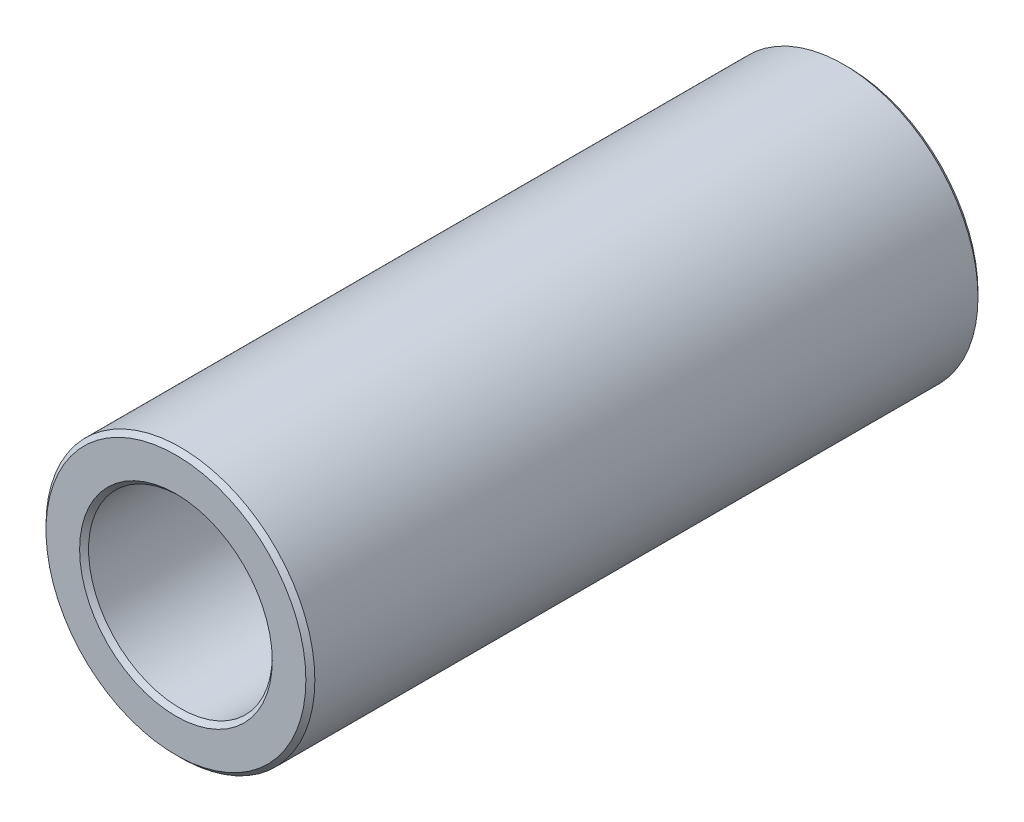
ISO-10303-21;
HEADER;
FILE_DESCRIPTION(('STEP AP214'),'2;1');
FILE_NAME('part.step','',(''),(''),'','','');
FILE_SCHEMA(('AUTOMOTIVE_DESIGN { 1 0 10303 214 1 1 1 1 }'));
ENDSEC;
DATA;
#1=APPLICATION_CONTEXT('core data for automotive mechanical design processes');
#2=APPLICATION_PROTOCOL_DEFINITION('international standard','automotive_design',2000,#1);
#3=PRODUCT_CONTEXT('',#1,'mechanical');
#4=PRODUCT('Part','Part','',(#3));
#5=PRODUCT_RELATED_PRODUCT_CATEGORY('part','',(#4));
#6=PRODUCT_DEFINITION_FORMATION('','',#4);
#7=PRODUCT_DEFINITION_CONTEXT('part definition',#1,'design');
#8=PRODUCT_DEFINITION('design','',#6,#7);
#9=PRODUCT_DEFINITION_SHAPE('','',#8);
#10=(LENGTH_UNIT() NAMED_UNIT(*) SI_UNIT(.MILLI.,.METRE.));
#11=(NAMED_UNIT(*) PLANE_ANGLE_UNIT() SI_UNIT($,.RADIAN.));
#12=(NAMED_UNIT(*) SI_UNIT($,.STERADIAN.) SOLID_ANGLE_UNIT());
#13=UNCERTAINTY_MEASURE_WITH_UNIT(LENGTH_MEASURE(1.E-05),#10,'distance_accuracy_value','');
#14=(GEOMETRIC_REPRESENTATION_CONTEXT(3) GLOBAL_UNCERTAINTY_ASSIGNED_CONTEXT((#13)) GLOBAL_UNIT_ASSIGNED_CONTEXT((#10,
#11,#12)) REPRESENTATION_CONTEXT('',''));
#15=CARTESIAN_POINT('',(0.,0.,0.));
#16=DIRECTION('',(0.,0.,1.));
#17=DIRECTION('',(1.,0.,0.));
#18=AXIS2_PLACEMENT_3D('',#15,#16,#17);
#19=CARTESIAN_POINT('',(0.,0.,15.));
#20=DIRECTION('',(0.,0.,1.));
#21=DIRECTION('',(1.,0.,0.));
#22=AXIS2_PLACEMENT_3D('',#19,#20,#21);
#23=PLANE('',#22);
#24=CARTESIAN_POINT('',(0.,0.,15.));
#25=DIRECTION('',(0.,0.,1.));
#26=DIRECTION('',(1.,0.,0.));
#27=AXIS2_PLACEMENT_3D('',#24,#25,#26);
#28=CIRCLE('',#27,4.29999999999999);
#29=CARTESIAN_POINT('',(4.29999999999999,0.,15.));
#30=VERTEX_POINT('',#29);
#31=EDGE_CURVE('E10',#30,#30,#28,.F.);
#32=ORIENTED_EDGE('',*,*,#31,.T.);
#33=EDGE_LOOP('',(#32));
#34=FACE_BOUND('',#33,.T.);
#35=CARTESIAN_POINT('',(0.,0.,15.));
#36=DIRECTION('',(0.,0.,1.));
#37=DIRECTION('',(1.,0.,0.));
#38=AXIS2_PLACEMENT_3D('',#35,#36,#37);
#39=CIRCLE('',#38,5.8);
#40=CARTESIAN_POINT('',(5.8,0.,15.));
#41=VERTEX_POINT('',#40);
#42=EDGE_CURVE('E45',#41,#41,#39,.T.);
#43=ORIENTED_EDGE('',*,*,#42,.T.);
#44=EDGE_LOOP('',(#43));
#45=FACE_BOUND('',#44,.T.);
#46=ADVANCED_FACE('F37',(#34,#45),#23,.T.);
#47=CARTESIAN_POINT('',(0.,0.,-15.));
#48=DIRECTION('',(0.,0.,1.));
#49=DIRECTION('',(1.,0.,0.));
#50=AXIS2_PLACEMENT_3D('',#47,#48,#49);
#51=PLANE('',#50);
#52=CARTESIAN_POINT('',(0.,0.,-15.));
#53=DIRECTION('',(0.,0.,1.));
#54=DIRECTION('',(1.,0.,0.));
#55=AXIS2_PLACEMENT_3D('',#52,#53,#54);
#56=CIRCLE('',#55,5.8);
#57=CARTESIAN_POINT('',(5.8,0.,-15.));
#58=VERTEX_POINT('',#57);
#59=EDGE_CURVE('E61',#58,#58,#56,.F.);
#60=ORIENTED_EDGE('',*,*,#59,.T.);
#61=EDGE_LOOP('',(#60));
#62=FACE_BOUND('',#61,.T.);
#63=CARTESIAN_POINT('',(0.,0.,-15.));
#64=DIRECTION('',(0.,0.,1.));
#65=DIRECTION('',(1.,0.,0.));
#66=AXIS2_PLACEMENT_3D('',#63,#64,#65);
#67=CIRCLE('',#66,4.3);
#68=CARTESIAN_POINT('',(4.3,0.,-15.));
#69=VERTEX_POINT('',#68);
#70=EDGE_CURVE('E65',#69,#69,#67,.T.);
#71=ORIENTED_EDGE('',*,*,#70,.T.);
#72=EDGE_LOOP('',(#71));
#73=FACE_BOUND('',#72,.T.);
#74=ADVANCED_FACE('F89',(#62,#73),#51,.F.);
#75=CARTESIAN_POINT('',(0.,0.,15.));
#76=DIRECTION('',(0.,0.,-1.));
#77=DIRECTION('',(-1.,0.,0.));
#78=AXIS2_PLACEMENT_3D('',#75,#76,#77);
#79=CYLINDRICAL_SURFACE('',#78,6.);
#80=CARTESIAN_POINT('',(0.,0.,-14.8));
#81=DIRECTION('',(0.,0.,1.));
#82=DIRECTION('',(1.,0.,0.));
#83=AXIS2_PLACEMENT_3D('',#80,#81,#82);
#84=CIRCLE('',#83,6.);
#85=CARTESIAN_POINT('',(6.,0.,-14.8));
#86=VERTEX_POINT('',#85);
#87=EDGE_CURVE('E69',#86,#86,#84,.T.);
#88=ORIENTED_EDGE('',*,*,#87,.T.);
#89=EDGE_LOOP('',(#88));
#90=FACE_BOUND('',#89,.T.);
#91=CARTESIAN_POINT('',(0.,0.,14.8));
#92=DIRECTION('',(0.,0.,1.));
#93=DIRECTION('',(1.,0.,0.));
#94=AXIS2_PLACEMENT_3D('',#91,#92,#93);
#95=CIRCLE('',#94,6.);
#96=CARTESIAN_POINT('',(6.,0.,14.8));
#97=VERTEX_POINT('',#96);
#98=EDGE_CURVE('E73',#97,#97,#95,.F.);
#99=ORIENTED_EDGE('',*,*,#98,.T.);
#100=EDGE_LOOP('',(#99));
#101=FACE_BOUND('',#100,.T.);
#102=ADVANCED_FACE('F78',(#90,#101),#79,.T.);
#103=CARTESIAN_POINT('',(0.,0.,15.));
#104=DIRECTION('',(0.,0.,-1.));
#105=DIRECTION('',(-1.,0.,0.));
#106=AXIS2_PLACEMENT_3D('',#103,#104,#105);
#107=CYLINDRICAL_SURFACE('',#106,4.1);
#108=CARTESIAN_POINT('',(0.,0.,-14.8));
#109=DIRECTION('',(0.,0.,1.));
#110=DIRECTION('',(1.,0.,0.));
#111=AXIS2_PLACEMENT_3D('',#108,#109,#110);
#112=CIRCLE('',#111,4.1);
#113=CARTESIAN_POINT('',(4.1,0.,-14.8));
#114=VERTEX_POINT('',#113);
#115=EDGE_CURVE('E51',#114,#114,#112,.F.);
#116=ORIENTED_EDGE('',*,*,#115,.T.);
#117=EDGE_LOOP('',(#116));
#118=FACE_BOUND('',#117,.T.);
#119=CARTESIAN_POINT('',(0.,0.,14.8));
#120=DIRECTION('',(0.,0.,1.));
#121=DIRECTION('',(1.,0.,0.));
#122=AXIS2_PLACEMENT_3D('',#119,#120,#121);
#123=CIRCLE('',#122,4.1);
#124=CARTESIAN_POINT('',(4.1,0.,14.8));
#125=VERTEX_POINT('',#124);
#126=EDGE_CURVE('E55',#125,#125,#123,.T.);
#127=ORIENTED_EDGE('',*,*,#126,.T.);
#128=EDGE_LOOP('',(#127));
#129=FACE_BOUND('',#128,.T.);
#130=ADVANCED_FACE('F97',(#118,#129),#107,.F.);
#131=CARTESIAN_POINT('',(0.,0.,-14.8));
#132=DIRECTION('',(0.,0.,1.));
#133=DIRECTION('',(1.,0.,0.));
#134=AXIS2_PLACEMENT_3D('',#131,#132,#133);
#135=CONICAL_SURFACE('',#134,6.,0.785398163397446);
#136=ORIENTED_EDGE('',*,*,#59,.F.);
#137=EDGE_LOOP('',(#136));
#138=FACE_BOUND('',#137,.T.);
#139=ORIENTED_EDGE('',*,*,#87,.F.);
#140=EDGE_LOOP('',(#139));
#141=FACE_BOUND('',#140,.T.);
#142=ADVANCED_FACE('F102',(#138,#141),#135,.T.);
#143=CARTESIAN_POINT('',(0.,0.,-15.));
#144=DIRECTION('',(0.,0.,-1.));
#145=DIRECTION('',(-1.,0.,0.));
#146=AXIS2_PLACEMENT_3D('',#143,#144,#145);
#147=CONICAL_SURFACE('',#146,4.3,0.785398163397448);
#148=ORIENTED_EDGE('',*,*,#115,.F.);
#149=EDGE_LOOP('',(#148));
#150=FACE_BOUND('',#149,.T.);
#151=ORIENTED_EDGE('',*,*,#70,.F.);
#152=EDGE_LOOP('',(#151));
#153=FACE_BOUND('',#152,.T.);
#154=ADVANCED_FACE('F86',(#150,#153),#147,.F.);
#155=CARTESIAN_POINT('',(0.,0.,14.8));
#156=DIRECTION('',(0.,0.,1.));
#157=DIRECTION('',(1.,0.,0.));
#158=AXIS2_PLACEMENT_3D('',#155,#156,#157);
#159=CONICAL_SURFACE('',#158,4.1,0.78539816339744);
#160=ORIENTED_EDGE('',*,*,#31,.F.);
#161=EDGE_LOOP('',(#160));
#162=FACE_BOUND('',#161,.T.);
#163=ORIENTED_EDGE('',*,*,#126,.F.);
#164=EDGE_LOOP('',(#163));
#165=FACE_BOUND('',#164,.T.);
#166=ADVANCED_FACE('F82',(#162,#165),#159,.F.);
#167=CARTESIAN_POINT('',(0.,0.,15.));
#168=DIRECTION('',(0.,0.,-1.));
#169=DIRECTION('',(-1.,0.,0.));
#170=AXIS2_PLACEMENT_3D('',#167,#168,#169);
#171=CONICAL_SURFACE('',#170,5.8,0.785398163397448);
#172=ORIENTED_EDGE('',*,*,#98,.F.);
#173=EDGE_LOOP('',(#172));
#174=FACE_BOUND('',#173,.T.);
#175=ORIENTED_EDGE('',*,*,#42,.F.);
#176=EDGE_LOOP('',(#175));
#177=FACE_BOUND('',#176,.T.);
#178=ADVANCED_FACE('F39',(#174,#177),#171,.T.);
#179=CLOSED_SHELL('',(#46,#74,#102,#130,#142,#154,#166,#178));
#180=MANIFOLD_SOLID_BREP('B2',#179);
#181=ADVANCED_BREP_SHAPE_REPRESENTATION('',(#18,#180),#14);
#182=SHAPE_DEFINITION_REPRESENTATION(#9,#181);
ENDSEC;
END-ISO-10303-21;
